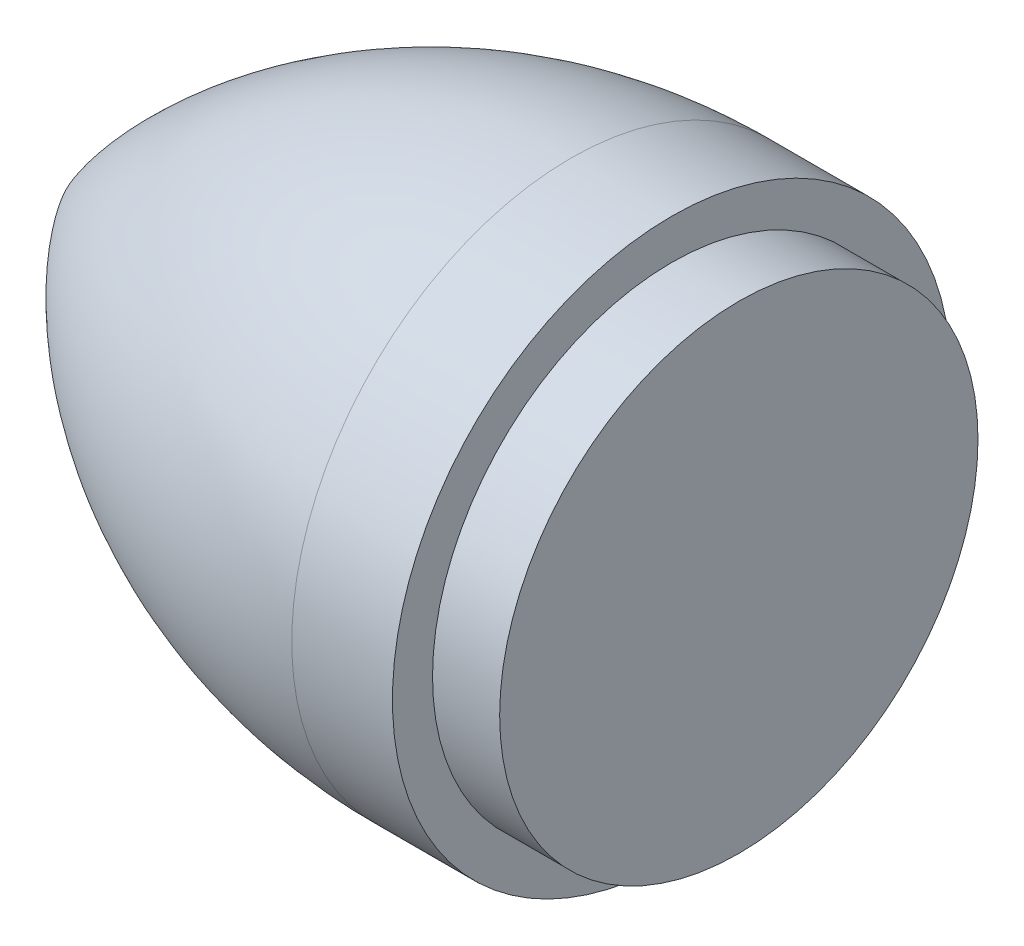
from build123d import *


with BuildPart() as part:
    # Sketch1 → Revolve4 (revolve)
    with BuildSketch(Plane.XY):
        with BuildLine():
            Line((0, 71.25), (0, 0))
            Line((0, 0), (-200, 0))
            ThreePointArc((-200, 0), (-135.76092383, 60.996702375), (-50, 83.185))
            Line((-50, 83.185), (-20, 83.185))
            Line((-20, 83.185), (-20, 71.25))
            Line((-20, 71.25), (0, 71.25))
        make_face()
    revolve(axis=Axis((0, 0, 0), (-1, 0, 0)))


solid = part.part
